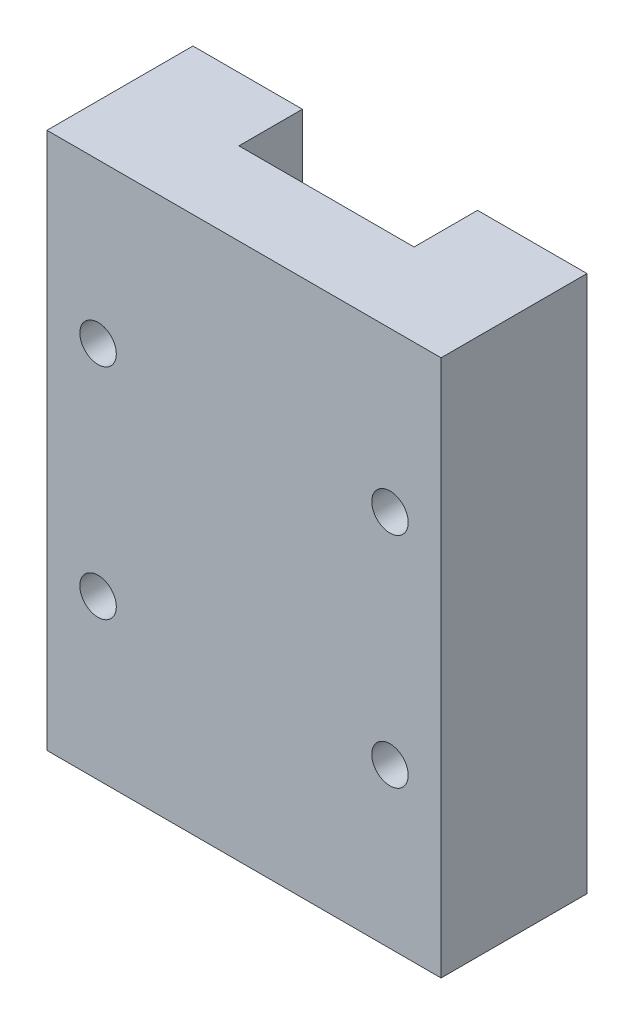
from build123d import *

# Parameters (mm, degrees)
SKETCH_2_W               = 27
SKETCH_2_H               = 36.8
SKETCH_2_R               = 1.25
EXTRUDE_1_DEPTH          = 10
CUT_EXTRUDE_1_DEPTH      = 47.725153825
CUT_EXTRUDE_1_DEPTH_BACK = 47.725153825
SKETCH_3_W               = 12
SKETCH_3_H               = 4.35


with BuildPart() as part:
    # Sketch 2 → Extrude 1 (new body)
    with BuildSketch(Plane.XY):
        with Locations((13.5, 18.4)):
            Rectangle(SKETCH_2_W, SKETCH_2_H)
        with Locations((23.5, 25.9)):
            Circle(SKETCH_2_R, mode=Mode.SUBTRACT)
        with Locations((3.5, 25.9)):
            Circle(SKETCH_2_R, mode=Mode.SUBTRACT)
        with Locations((3.5, 10.9)):
            Circle(SKETCH_2_R, mode=Mode.SUBTRACT)
        with Locations((23.5, 10.9)):
            Circle(SKETCH_2_R, mode=Mode.SUBTRACT)
    extrude(amount=EXTRUDE_1_DEPTH)

    # Sketch 3 → Cut-Extrude 1 (cut, two sides: drawn at the far end of the back side and taken through both)
    with BuildSketch(Plane(origin=(0, 36.8, 0), x_dir=(1, 0, 0), z_dir=(0, 1, 0)).offset(-CUT_EXTRUDE_1_DEPTH_BACK)):
        with Locations((13.5, -2.175)):
            Rectangle(SKETCH_3_W, SKETCH_3_H)
    extrude(amount=CUT_EXTRUDE_1_DEPTH + CUT_EXTRUDE_1_DEPTH_BACK, mode=Mode.SUBTRACT)


solid = part.part
